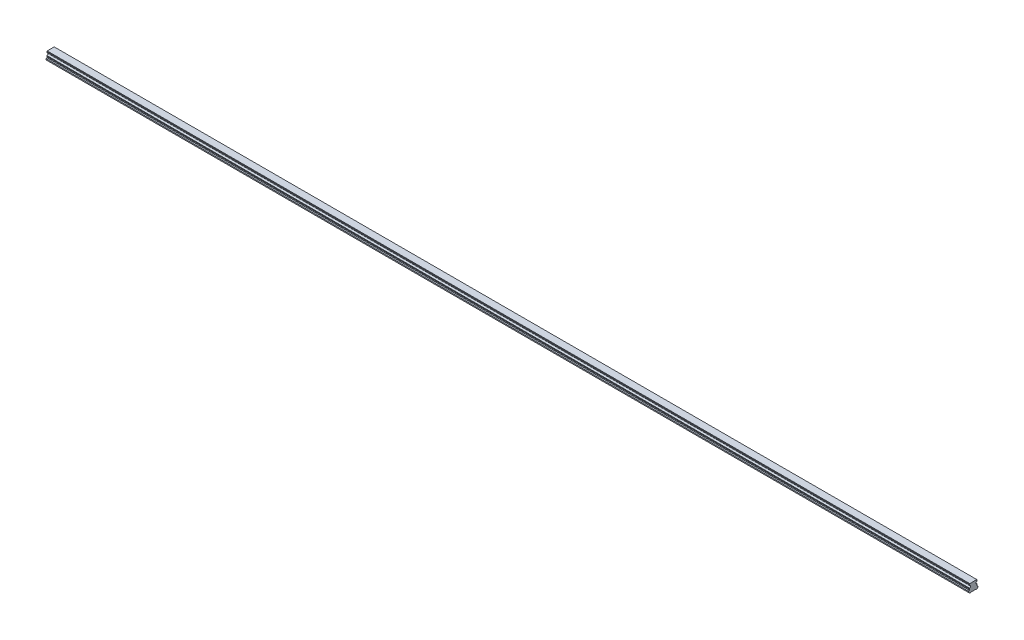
from build123d import *

# Parameters (mm, degrees)
BOSS_EXTRUDE1_DEPTH        = 2460
SKETCH3_R                  = 3
SKETCH3_R_2                = 2.5
CUT_EXTRUDE3_DEPTH         = 12
SKETCH3_2_R                = 2.5
CUT_EXTRUDE4_DEPTH         = 15
CHAMFER1_SIZE              = 0.5
LPATTERN4_COUNT            = 41
LPATTERN4_PITCH            = 60
CHAMFER1_OF_LPATTERN4_SIZE = 0.5


with BuildPart() as part:
    # Sketch1 → Boss-Extrude1 (new body)
    with BuildSketch(Plane(origin=(0, 0, 0), x_dir=(0, 0, -1), z_dir=(1, 0, 0))):
        with BuildLine():
            Line((9.375, 21.8), (-9.375, 21.8))
            Line((-9.375, 21.8), (-9.375, 20.756))
            Line((-9.375, 20.756), (-10, 19.415683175))
            Line((-10, 19.415683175), (-10, 17.685449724))
            ThreePointArc((-10, 17.685449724), (-7.2, 14.6), (-10, 11.514550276))
            Line((-10, 11.514550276), (-10, 9.784316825))
            Line((-10, 9.784316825), (-9.375, 8.444))
            Line((-9.375, 8.444), (-9.922688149, 6.4))
            Line((-9.922688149, 6.4), (-12.5, 5.489338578))
            Line((-12.5, 5.489338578), (-12.5, 2.65))
            Line((-12.5, 2.65), (-9.85, 0))
            Line((-9.85, 0), (-5.5, 0))
            Line((-5.5, 0), (-5, 0.5))
            Line((-5, 0.5), (5, 0.5))
            Line((5, 0.5), (5.5, 0))
            Line((5.5, 0), (9.85, 0))
            Line((9.85, 0), (12.5, 2.65))
            Line((12.5, 2.65), (12.5, 5.489338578))
            Line((12.5, 5.489338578), (9.922688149, 6.4))
            Line((9.922688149, 6.4), (9.375, 8.444))
            Line((9.375, 8.444), (10, 9.784316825))
            Line((10, 9.784316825), (10, 11.514550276))
            ThreePointArc((10, 11.514550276), (7.2, 14.6), (10, 17.685449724))
            Line((10, 17.685449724), (10, 19.415683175))
            Line((10, 19.415683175), (9.375, 20.756))
            Line((9.375, 20.756), (9.375, 21.8))
        make_face()
    extrude(amount=BOSS_EXTRUDE1_DEPTH)

    # Sketch3 → Cut-Extrude3 (cut)
    with BuildSketch(Plane.XZ):
        with Locations(Location((30, 0, 0), (0, 0, 270))):
            Circle(SKETCH3_R)
        with Locations(Location((30, 0, 0), (0, 0, 270))):
            Circle(SKETCH3_R_2, mode=Mode.SUBTRACT)
    cut_extrude3 = extrude(amount=-CUT_EXTRUDE3_DEPTH, mode=Mode.SUBTRACT)

    # Sketch3_2 → Cut-Extrude4 (cut)
    with BuildSketch(Plane.XZ):
        with Locations(Location((30, 0, 0), (0, 0, 270))):
            Circle(SKETCH3_2_R)
    cut_extrude4 = extrude(amount=-CUT_EXTRUDE4_DEPTH, mode=Mode.SUBTRACT)

    # Cut-Extrude5 cone 1 section (on through the dimple's axis) → Cut-Extrude5 (revolve, cut)
    with BuildSketch(Plane(origin=(30, 15, 0), x_dir=(0, 0, -1), z_dir=(1, 0, 0))):
        Polygon((0, 0), (2.5, 0), (0, 1.443375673), align=None)
    cut_extrude5 = revolve(axis=Axis((30, 15, 0), (0, 1, 0)), mode=Mode.SUBTRACT)

    # Chamfer1
    chamfer1_edges = [part.edges().sort_by_distance(p)[0] for p in [
        (30, 0.5, 3),
    ]]
    chamfer(chamfer1_edges, length=CHAMFER1_SIZE)

    # LPattern4: Cut-Extrude3, Cut-Extrude4, Cut-Extrude5 ×41
    with Locations(*[(i * LPATTERN4_PITCH, 0, 0) for i in range(1, LPATTERN4_COUNT)]):
        add(cut_extrude3, mode=Mode.SUBTRACT)
        add(cut_extrude4, mode=Mode.SUBTRACT)
        add(cut_extrude5, mode=Mode.SUBTRACT)

    # Chamfer1 of LPattern4
    chamfer1_of_lpattern4_edges = [part.edges().sort_by_distance(p)[0] for p in [
        (90, 0.5, 3),
        (150, 0.5, 3),
        (210, 0.5, 3),
        (270, 0.5, 3),
        (330, 0.5, 3),
        (390, 0.5, 3),
        (450, 0.5, 3),
        (510, 0.5, 3),
        (570, 0.5, 3),
        (630, 0.5, 3),
        (690, 0.5, 3),
        (750, 0.5, 3),
        (810, 0.5, 3),
        (870, 0.5, 3),
        (930, 0.5, 3),
        (990, 0.5, 3),
        (1050, 0.5, 3),
        (1110, 0.5, 3),
        (1170, 0.5, 3),
        (1230, 0.5, 3),
        (1290, 0.5, 3),
        (1350, 0.5, 3),
        (1410, 0.5, 3),
        (1470, 0.5, 3),
        (1530, 0.5, 3),
        (1590, 0.5, 3),
        (1650, 0.5, 3),
        (1710, 0.5, 3),
        (1770, 0.5, 3),
        (1830, 0.5, 3),
        (1890, 0.5, 3),
        (1950, 0.5, 3),
        (2010, 0.5, 3),
        (2070, 0.5, 3),
        (2130, 0.5, 3),
        (2190, 0.5, 3),
        (2250, 0.5, 3),
        (2310, 0.5, 3),
        (2370, 0.5, 3),
        (2430, 0.5, 3),
    ]]
    chamfer(chamfer1_of_lpattern4_edges, length=CHAMFER1_OF_LPATTERN4_SIZE)


solid = part.part
